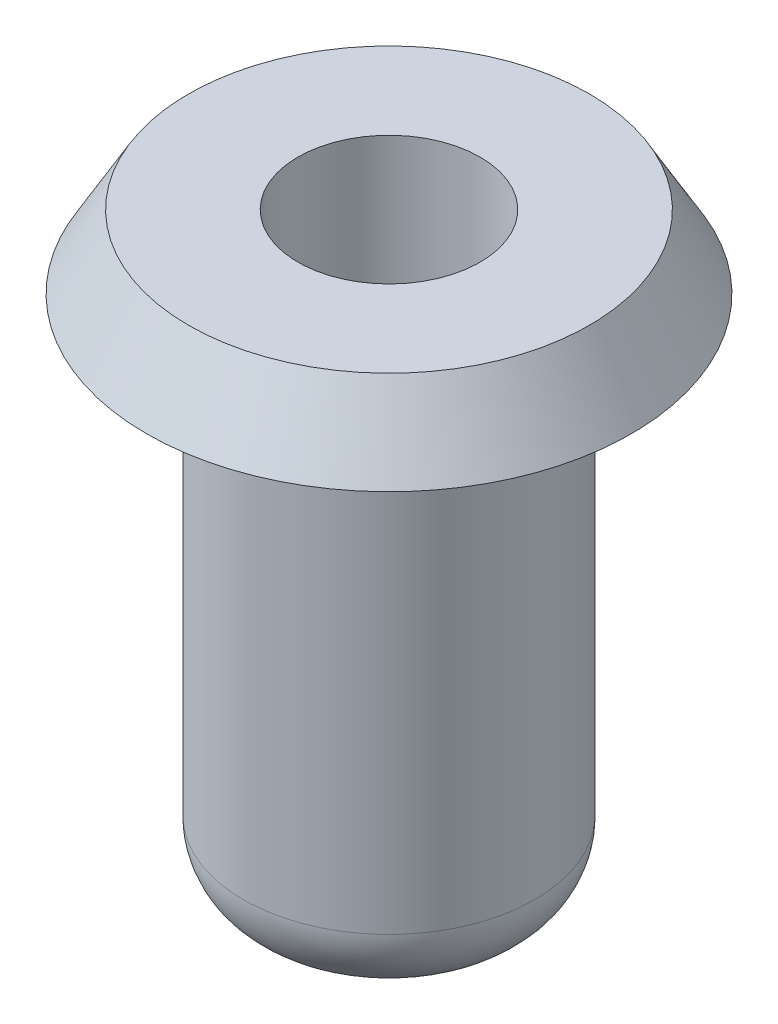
from build123d import *


with BuildPart() as part:
    # Esquisse1 → R_volution1 (revolve)
    with BuildSketch(Plane.XY, mode=Mode.PRIVATE) as r_volution1_sk:
        with BuildLine():
            Line((-2.75, 8.2), (-1.25, 8.2))
            Line((-1.25, 8.2), (-1.25, 2))
            Line((-1.25, 2), (0, 2))
            Line((0, 2), (0, 0))
            Line((0, 0), (-1, 0))
            ThreePointArc((-1, 0), (-1.707106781, 0.292893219), (-2, 1))
            Line((-2, 1), (-2, 7.2))
            Line((-2, 7.2), (-3.327350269, 7.2))
            Line((-3.327350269, 7.2), (-2.75, 8.2))
        make_face()
    revolve(r_volution1_sk.sketch.rotate(Axis((0, 0, 0), (0, 1, 0)), 270), axis=Axis((0, 0, 0), (0, 1, 0)))


solid = part.part
